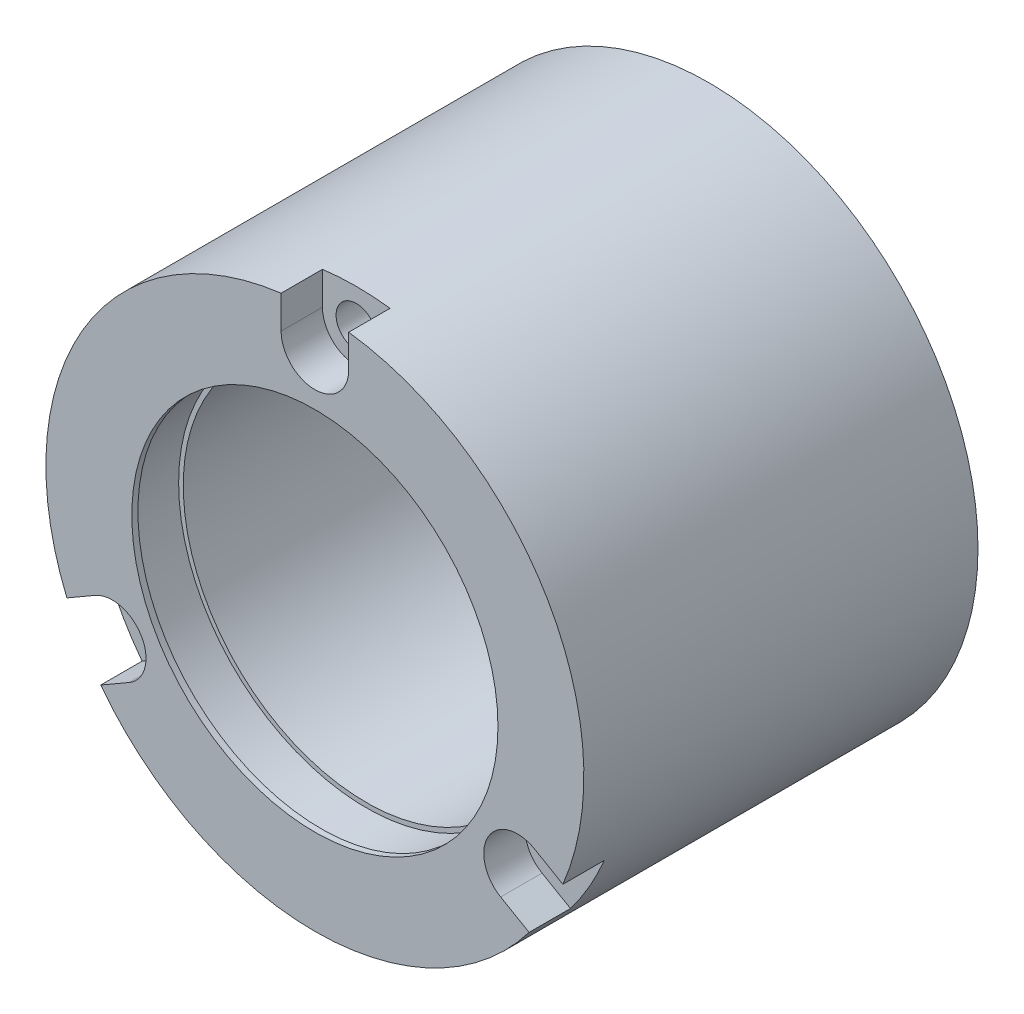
ISO-10303-21;
HEADER;
FILE_DESCRIPTION(('STEP AP214'),'2;1');
FILE_NAME('part.step','',(''),(''),'','','');
FILE_SCHEMA(('AUTOMOTIVE_DESIGN { 1 0 10303 214 1 1 1 1 }'));
ENDSEC;
DATA;
#1=APPLICATION_CONTEXT('core data for automotive mechanical design processes');
#2=APPLICATION_PROTOCOL_DEFINITION('international standard','automotive_design',2000,#1);
#3=PRODUCT_CONTEXT('',#1,'mechanical');
#4=PRODUCT('Part','Part','',(#3));
#5=PRODUCT_RELATED_PRODUCT_CATEGORY('part','',(#4));
#6=PRODUCT_DEFINITION_FORMATION('','',#4);
#7=PRODUCT_DEFINITION_CONTEXT('part definition',#1,'design');
#8=PRODUCT_DEFINITION('design','',#6,#7);
#9=PRODUCT_DEFINITION_SHAPE('','',#8);
#10=(LENGTH_UNIT() NAMED_UNIT(*) SI_UNIT(.MILLI.,.METRE.));
#11=(NAMED_UNIT(*) PLANE_ANGLE_UNIT() SI_UNIT($,.RADIAN.));
#12=(NAMED_UNIT(*) SI_UNIT($,.STERADIAN.) SOLID_ANGLE_UNIT());
#13=UNCERTAINTY_MEASURE_WITH_UNIT(LENGTH_MEASURE(1.E-05),#10,'distance_accuracy_value','');
#14=(GEOMETRIC_REPRESENTATION_CONTEXT(3) GLOBAL_UNCERTAINTY_ASSIGNED_CONTEXT((#13)) GLOBAL_UNIT_ASSIGNED_CONTEXT((#10,
#11,#12)) REPRESENTATION_CONTEXT('',''));
#15=CARTESIAN_POINT('',(0.,0.,0.));
#16=DIRECTION('',(0.,0.,1.));
#17=DIRECTION('',(1.,0.,0.));
#18=AXIS2_PLACEMENT_3D('',#15,#16,#17);
#19=CARTESIAN_POINT('',(0.,0.,0.));
#20=DIRECTION('',(0.,0.,1.));
#21=DIRECTION('',(1.,0.,0.));
#22=AXIS2_PLACEMENT_3D('',#19,#20,#21);
#23=PLANE('',#22);
#24=CARTESIAN_POINT('',(0.,0.,0.));
#25=DIRECTION('',(0.,0.,1.));
#26=DIRECTION('',(1.,0.,0.));
#27=AXIS2_PLACEMENT_3D('',#24,#25,#26);
#28=CIRCLE('',#27,23.5966);
#29=CARTESIAN_POINT('',(23.5966,0.,0.));
#30=VERTEX_POINT('',#29);
#31=EDGE_CURVE('E700',#30,#30,#28,.T.);
#32=ORIENTED_EDGE('',*,*,#31,.T.);
#33=EDGE_LOOP('',(#32));
#34=FACE_BOUND('',#33,.T.);
#35=CARTESIAN_POINT('',(0.,0.,0.));
#36=DIRECTION('',(0.,0.,-1.));
#37=DIRECTION('',(-1.,0.,0.));
#38=AXIS2_PLACEMENT_3D('',#35,#36,#37);
#39=CIRCLE('',#38,25.2603);
#40=CARTESIAN_POINT('',(-25.2603,0.,0.));
#41=VERTEX_POINT('',#40);
#42=EDGE_CURVE('E730',#41,#41,#39,.T.);
#43=ORIENTED_EDGE('',*,*,#42,.T.);
#44=EDGE_LOOP('',(#43));
#45=FACE_BOUND('',#44,.T.);
#46=ADVANCED_FACE('F17',(#34,#45),#23,.F.);
#47=CARTESIAN_POINT('',(0.,0.,50.8));
#48=DIRECTION('',(0.,0.,-1.));
#49=DIRECTION('',(-1.,0.,0.));
#50=AXIS2_PLACEMENT_3D('',#47,#48,#49);
#51=CYLINDRICAL_SURFACE('',#50,34.671);
#52=CARTESIAN_POINT('',(0.,0.,0.));
#53=DIRECTION('',(0.,0.,1.));
#54=DIRECTION('',(1.,0.,0.));
#55=AXIS2_PLACEMENT_3D('',#52,#53,#54);
#56=CIRCLE('',#55,34.671);
#57=CARTESIAN_POINT('',(34.671,0.,0.));
#58=VERTEX_POINT('',#57);
#59=EDGE_CURVE('E21',#58,#58,#56,.T.);
#60=ORIENTED_EDGE('',*,*,#59,.T.);
#61=EDGE_LOOP('',(#60));
#62=FACE_BOUND('',#61,.T.);
#63=DIRECTION('',(0.,0.,-1.));
#64=VECTOR('',#63,1.);
#65=CARTESIAN_POINT('',(27.6099840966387,-20.9706227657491,50.8));
#66=LINE('',#65,#64);
#67=CARTESIAN_POINT('',(27.6099840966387,-20.9706227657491,50.8));
#68=VERTEX_POINT('',#67);
#69=CARTESIAN_POINT('',(27.6099840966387,-20.9706227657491,45.466));
#70=VERTEX_POINT('',#69);
#71=EDGE_CURVE('E152',#68,#70,#66,.T.);
#72=ORIENTED_EDGE('',*,*,#71,.F.);
#73=CARTESIAN_POINT('',(0.,0.,50.8));
#74=DIRECTION('',(0.,0.,1.));
#75=DIRECTION('',(1.,0.,0.));
#76=AXIS2_PLACEMENT_3D('',#73,#74,#75);
#77=CIRCLE('',#76,34.671);
#78=CARTESIAN_POINT('',(-27.6099840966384,-20.9706227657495,50.8));
#79=VERTEX_POINT('',#78);
#80=EDGE_CURVE('E27',#79,#68,#77,.T.);
#81=ORIENTED_EDGE('',*,*,#80,.F.);
#82=DIRECTION('',(0.,0.,-1.));
#83=VECTOR('',#82,1.);
#84=CARTESIAN_POINT('',(-27.6099840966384,-20.9706227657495,50.8));
#85=LINE('',#84,#83);
#86=CARTESIAN_POINT('',(-27.6099840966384,-20.9706227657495,45.466));
#87=VERTEX_POINT('',#86);
#88=EDGE_CURVE('E779',#79,#87,#85,.T.);
#89=ORIENTED_EDGE('',*,*,#88,.T.);
#90=CARTESIAN_POINT('',(0.,0.,45.466));
#91=DIRECTION('',(0.,0.,1.));
#92=DIRECTION('',(-0.500000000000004,0.866025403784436,0.));
#93=AXIS2_PLACEMENT_3D('',#90,#91,#92);
#94=CIRCLE('',#93,34.671);
#95=CARTESIAN_POINT('',(-31.9660840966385,-13.4256362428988,45.466));
#96=VERTEX_POINT('',#95);
#97=EDGE_CURVE('E772',#96,#87,#94,.T.);
#98=ORIENTED_EDGE('',*,*,#97,.F.);
#99=DIRECTION('',(0.,0.,-1.));
#100=VECTOR('',#99,1.);
#101=CARTESIAN_POINT('',(-31.9660840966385,-13.4256362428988,50.8));
#102=LINE('',#101,#100);
#103=CARTESIAN_POINT('',(-31.9660840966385,-13.4256362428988,50.8));
#104=VERTEX_POINT('',#103);
#105=EDGE_CURVE('E178',#104,#96,#102,.T.);
#106=ORIENTED_EDGE('',*,*,#105,.F.);
#107=CARTESIAN_POINT('',(-4.35609999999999,34.396259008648,50.8));
#108=VERTEX_POINT('',#107);
#109=EDGE_CURVE('E11',#108,#104,#77,.T.);
#110=ORIENTED_EDGE('',*,*,#109,.F.);
#111=DIRECTION('',(0.,0.,-1.));
#112=VECTOR('',#111,1.);
#113=CARTESIAN_POINT('',(-4.35609999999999,34.396259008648,50.8));
#114=LINE('',#113,#112);
#115=CARTESIAN_POINT('',(-4.35609999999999,34.396259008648,45.466));
#116=VERTEX_POINT('',#115);
#117=EDGE_CURVE('E209',#108,#116,#114,.T.);
#118=ORIENTED_EDGE('',*,*,#117,.T.);
#119=CARTESIAN_POINT('',(0.,0.,45.466));
#120=DIRECTION('',(0.,0.,1.));
#121=DIRECTION('',(1.,0.,0.));
#122=AXIS2_PLACEMENT_3D('',#119,#120,#121);
#123=CIRCLE('',#122,34.671);
#124=CARTESIAN_POINT('',(4.35609999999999,34.396259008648,45.466));
#125=VERTEX_POINT('',#124);
#126=EDGE_CURVE('E201',#125,#116,#123,.T.);
#127=ORIENTED_EDGE('',*,*,#126,.F.);
#128=DIRECTION('',(0.,0.,-1.));
#129=VECTOR('',#128,1.);
#130=CARTESIAN_POINT('',(4.35609999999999,34.396259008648,50.8));
#131=LINE('',#130,#129);
#132=CARTESIAN_POINT('',(4.35609999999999,34.396259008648,50.8));
#133=VERTEX_POINT('',#132);
#134=EDGE_CURVE('E213',#133,#125,#131,.T.);
#135=ORIENTED_EDGE('',*,*,#134,.F.);
#136=CARTESIAN_POINT('',(31.9660840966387,-13.4256362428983,50.8));
#137=VERTEX_POINT('',#136);
#138=EDGE_CURVE('E28',#137,#133,#77,.T.);
#139=ORIENTED_EDGE('',*,*,#138,.F.);
#140=DIRECTION('',(0.,0.,-1.));
#141=VECTOR('',#140,1.);
#142=CARTESIAN_POINT('',(31.9660840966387,-13.4256362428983,50.8));
#143=LINE('',#142,#141);
#144=CARTESIAN_POINT('',(31.9660840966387,-13.4256362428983,45.466));
#145=VERTEX_POINT('',#144);
#146=EDGE_CURVE('E757',#137,#145,#143,.T.);
#147=ORIENTED_EDGE('',*,*,#146,.T.);
#148=CARTESIAN_POINT('',(0.,0.,45.466));
#149=DIRECTION('',(0.,0.,1.));
#150=DIRECTION('',(-0.499999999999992,-0.866025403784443,0.));
#151=AXIS2_PLACEMENT_3D('',#148,#149,#150);
#152=CIRCLE('',#151,34.671);
#153=EDGE_CURVE('E750',#70,#145,#152,.T.);
#154=ORIENTED_EDGE('',*,*,#153,.F.);
#155=EDGE_LOOP('',(#72,#81,#89,#98,#106,#110,#118,#127,#135,#139,#147,#154));
#156=FACE_BOUND('',#155,.T.);
#157=ADVANCED_FACE('F19',(#62,#156),#51,.T.);
#158=CARTESIAN_POINT('',(0.,0.,50.8));
#159=DIRECTION('',(0.,0.,1.));
#160=DIRECTION('',(1.,0.,0.));
#161=AXIS2_PLACEMENT_3D('',#158,#159,#160);
#162=PLANE('',#161);
#163=CARTESIAN_POINT('',(0.,0.,50.8));
#164=DIRECTION('',(0.,0.,1.));
#165=DIRECTION('',(1.,0.,0.));
#166=AXIS2_PLACEMENT_3D('',#163,#164,#165);
#167=CIRCLE('',#166,23.5966);
#168=CARTESIAN_POINT('',(23.5966,0.,50.8));
#169=VERTEX_POINT('',#168);
#170=EDGE_CURVE('E699',#169,#169,#167,.T.);
#171=ORIENTED_EDGE('',*,*,#170,.F.);
#172=EDGE_LOOP('',(#171));
#173=FACE_BOUND('',#172,.T.);
#174=ORIENTED_EDGE('',*,*,#80,.T.);
#175=DIRECTION('',(0.866025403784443,-0.499999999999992,0.));
#176=VECTOR('',#175,1.);
#177=CARTESIAN_POINT('',(27.6099840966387,-20.9706227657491,50.8));
#178=LINE('',#177,#176);
#179=CARTESIAN_POINT('',(23.9434412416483,-18.8537432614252,50.8));
#180=VERTEX_POINT('',#179);
#181=EDGE_CURVE('E143',#180,#68,#178,.T.);
#182=ORIENTED_EDGE('',*,*,#181,.F.);
#183=CARTESIAN_POINT('',(26.1214912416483,-15.0812499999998,50.8));
#184=DIRECTION('',(0.,0.,1.));
#185=DIRECTION('',(1.,0.,0.));
#186=AXIS2_PLACEMENT_3D('',#183,#184,#185);
#187=CIRCLE('',#186,4.35609999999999);
#188=CARTESIAN_POINT('',(28.2995412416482,-11.3087567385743,50.8));
#189=VERTEX_POINT('',#188);
#190=EDGE_CURVE('E159',#189,#180,#187,.T.);
#191=ORIENTED_EDGE('',*,*,#190,.F.);
#192=DIRECTION('',(-0.866025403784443,0.499999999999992,0.));
#193=VECTOR('',#192,1.);
#194=CARTESIAN_POINT('',(31.9660840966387,-13.4256362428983,50.8));
#195=LINE('',#194,#193);
#196=EDGE_CURVE('E163',#137,#189,#195,.T.);
#197=ORIENTED_EDGE('',*,*,#196,.F.);
#198=ORIENTED_EDGE('',*,*,#138,.T.);
#199=DIRECTION('',(0.,1.,0.));
#200=VECTOR('',#199,1.);
#201=CARTESIAN_POINT('',(4.35609999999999,34.396259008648,50.8));
#202=LINE('',#201,#200);
#203=CARTESIAN_POINT('',(4.3561,30.1625,50.8));
#204=VERTEX_POINT('',#203);
#205=EDGE_CURVE('E190',#204,#133,#202,.T.);
#206=ORIENTED_EDGE('',*,*,#205,.F.);
#207=CARTESIAN_POINT('',(0.,30.1625,50.8));
#208=DIRECTION('',(0.,0.,1.));
#209=DIRECTION('',(1.,0.,0.));
#210=AXIS2_PLACEMENT_3D('',#207,#208,#209);
#211=CIRCLE('',#210,4.35609999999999);
#212=CARTESIAN_POINT('',(-4.35609999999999,30.1625,50.8));
#213=VERTEX_POINT('',#212);
#214=EDGE_CURVE('E221',#213,#204,#211,.T.);
#215=ORIENTED_EDGE('',*,*,#214,.F.);
#216=DIRECTION('',(0.,-1.,0.));
#217=VECTOR('',#216,1.);
#218=CARTESIAN_POINT('',(-4.35609999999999,34.396259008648,50.8));
#219=LINE('',#218,#217);
#220=EDGE_CURVE('E194',#108,#213,#219,.T.);
#221=ORIENTED_EDGE('',*,*,#220,.F.);
#222=ORIENTED_EDGE('',*,*,#109,.T.);
#223=DIRECTION('',(-0.866025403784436,-0.500000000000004,0.));
#224=VECTOR('',#223,1.);
#225=CARTESIAN_POINT('',(-31.9660840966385,-13.4256362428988,50.8));
#226=LINE('',#225,#224);
#227=CARTESIAN_POINT('',(-28.2995412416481,-11.3087567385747,50.8));
#228=VERTEX_POINT('',#227);
#229=EDGE_CURVE('E763',#228,#104,#226,.T.);
#230=ORIENTED_EDGE('',*,*,#229,.F.);
#231=CARTESIAN_POINT('',(-26.1214912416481,-15.0812500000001,50.8));
#232=DIRECTION('',(0.,0.,1.));
#233=DIRECTION('',(1.,0.,0.));
#234=AXIS2_PLACEMENT_3D('',#231,#232,#233);
#235=CIRCLE('',#234,4.35609999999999);
#236=CARTESIAN_POINT('',(-23.943441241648,-18.8537432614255,50.8));
#237=VERTEX_POINT('',#236);
#238=EDGE_CURVE('E175',#237,#228,#235,.T.);
#239=ORIENTED_EDGE('',*,*,#238,.F.);
#240=DIRECTION('',(0.866025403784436,0.500000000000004,0.));
#241=VECTOR('',#240,1.);
#242=CARTESIAN_POINT('',(-27.6099840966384,-20.9706227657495,50.8));
#243=LINE('',#242,#241);
#244=EDGE_CURVE('E766',#79,#237,#243,.T.);
#245=ORIENTED_EDGE('',*,*,#244,.F.);
#246=EDGE_LOOP('',(#174,#182,#191,#197,#198,#206,#215,#221,#222,#230,#239,#245));
#247=FACE_BOUND('',#246,.T.);
#248=ADVANCED_FACE('F157',(#173,#247),#162,.T.);
#249=CARTESIAN_POINT('',(0.,30.1625,0.));
#250=DIRECTION('',(0.,0.,1.));
#251=DIRECTION('',(1.,0.,0.));
#252=AXIS2_PLACEMENT_3D('',#249,#250,#251);
#253=CIRCLE('',#252,2.60349999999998);
#254=CARTESIAN_POINT('',(2.60349999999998,30.1625,0.));
#255=VERTEX_POINT('',#254);
#256=EDGE_CURVE('E713',#255,#255,#253,.T.);
#257=ORIENTED_EDGE('',*,*,#256,.T.);
#258=EDGE_LOOP('',(#257));
#259=FACE_BOUND('',#258,.T.);
#260=CARTESIAN_POINT('',(-26.1214912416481,-15.0812500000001,0.));
#261=DIRECTION('',(0.,0.,1.));
#262=DIRECTION('',(1.,0.,0.));
#263=AXIS2_PLACEMENT_3D('',#260,#261,#262);
#264=CIRCLE('',#263,2.60349999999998);
#265=CARTESIAN_POINT('',(-23.5179912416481,-15.0812500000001,0.));
#266=VERTEX_POINT('',#265);
#267=EDGE_CURVE('E849',#266,#266,#264,.T.);
#268=ORIENTED_EDGE('',*,*,#267,.T.);
#269=EDGE_LOOP('',(#268));
#270=FACE_BOUND('',#269,.T.);
#271=CARTESIAN_POINT('',(26.1214912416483,-15.0812499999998,0.));
#272=DIRECTION('',(0.,0.,1.));
#273=DIRECTION('',(1.,0.,0.));
#274=AXIS2_PLACEMENT_3D('',#271,#272,#273);
#275=CIRCLE('',#274,2.60349999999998);
#276=CARTESIAN_POINT('',(28.7249912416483,-15.0812499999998,0.));
#277=VERTEX_POINT('',#276);
#278=EDGE_CURVE('E859',#277,#277,#275,.T.);
#279=ORIENTED_EDGE('',*,*,#278,.T.);
#280=EDGE_LOOP('',(#279));
#281=FACE_BOUND('',#280,.T.);
#282=CARTESIAN_POINT('',(0.,0.,0.));
#283=DIRECTION('',(0.,0.,-1.));
#284=DIRECTION('',(-1.,0.,0.));
#285=AXIS2_PLACEMENT_3D('',#282,#283,#284);
#286=CIRCLE('',#285,27.0383);
#287=CARTESIAN_POINT('',(-27.0383,0.,0.));
#288=VERTEX_POINT('',#287);
#289=EDGE_CURVE('E735',#288,#288,#286,.T.);
#290=ORIENTED_EDGE('',*,*,#289,.F.);
#291=EDGE_LOOP('',(#290));
#292=FACE_BOUND('',#291,.T.);
#293=ORIENTED_EDGE('',*,*,#59,.F.);
#294=EDGE_LOOP('',(#293));
#295=FACE_BOUND('',#294,.T.);
#296=ADVANCED_FACE('F364',(#259,#270,#281,#292,#295),#23,.F.);
#297=CARTESIAN_POINT('',(2.6035,30.1625,45.466));
#298=DIRECTION('',(0.,0.,-1.));
#299=DIRECTION('',(-1.,0.,0.));
#300=AXIS2_PLACEMENT_3D('',#297,#298,#299);
#301=PLANE('',#300);
#302=CARTESIAN_POINT('',(0.,30.1625,45.466));
#303=DIRECTION('',(0.,0.,1.));
#304=DIRECTION('',(1.,0.,0.));
#305=AXIS2_PLACEMENT_3D('',#302,#303,#304);
#306=CIRCLE('',#305,2.6035);
#307=CARTESIAN_POINT('',(2.6035,30.1625,45.466));
#308=VERTEX_POINT('',#307);
#309=EDGE_CURVE('E709',#308,#308,#306,.T.);
#310=ORIENTED_EDGE('',*,*,#309,.F.);
#311=EDGE_LOOP('',(#310));
#312=FACE_BOUND('',#311,.T.);
#313=CARTESIAN_POINT('',(0.,30.1625,45.466));
#314=DIRECTION('',(0.,0.,1.));
#315=DIRECTION('',(1.,0.,0.));
#316=AXIS2_PLACEMENT_3D('',#313,#314,#315);
#317=CIRCLE('',#316,4.3561);
#318=CARTESIAN_POINT('',(-4.3561,30.1625,45.466));
#319=VERTEX_POINT('',#318);
#320=CARTESIAN_POINT('',(4.3561,30.1625,45.466));
#321=VERTEX_POINT('',#320);
#322=EDGE_CURVE('E225',#319,#321,#317,.T.);
#323=ORIENTED_EDGE('',*,*,#322,.T.);
#324=DIRECTION('',(0.,1.,0.));
#325=VECTOR('',#324,1.);
#326=CARTESIAN_POINT('',(4.35609999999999,34.396259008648,45.466));
#327=LINE('',#326,#325);
#328=EDGE_CURVE('E189',#321,#125,#327,.T.);
#329=ORIENTED_EDGE('',*,*,#328,.T.);
#330=ORIENTED_EDGE('',*,*,#126,.T.);
#331=DIRECTION('',(0.,-1.,0.));
#332=VECTOR('',#331,1.);
#333=CARTESIAN_POINT('',(-4.35609999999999,34.396259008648,45.466));
#334=LINE('',#333,#332);
#335=EDGE_CURVE('E195',#116,#319,#334,.T.);
#336=ORIENTED_EDGE('',*,*,#335,.T.);
#337=EDGE_LOOP('',(#323,#329,#330,#336));
#338=FACE_BOUND('',#337,.T.);
#339=ADVANCED_FACE('F356',(#312,#338),#301,.F.);
#340=CARTESIAN_POINT('',(0.,30.1625,50.8));
#341=DIRECTION('',(0.,0.,1.));
#342=DIRECTION('',(1.,0.,0.));
#343=AXIS2_PLACEMENT_3D('',#340,#341,#342);
#344=CYLINDRICAL_SURFACE('',#343,4.3561);
#345=ORIENTED_EDGE('',*,*,#214,.T.);
#346=DIRECTION('',(0.,0.,-1.));
#347=VECTOR('',#346,1.);
#348=CARTESIAN_POINT('',(4.3561,30.1625,50.8));
#349=LINE('',#348,#347);
#350=EDGE_CURVE('E217',#204,#321,#349,.T.);
#351=ORIENTED_EDGE('',*,*,#350,.T.);
#352=ORIENTED_EDGE('',*,*,#322,.F.);
#353=DIRECTION('',(0.,0.,-1.));
#354=VECTOR('',#353,1.);
#355=CARTESIAN_POINT('',(-4.35609999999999,30.1625,50.8));
#356=LINE('',#355,#354);
#357=EDGE_CURVE('E198',#213,#319,#356,.T.);
#358=ORIENTED_EDGE('',*,*,#357,.F.);
#359=EDGE_LOOP('',(#345,#351,#352,#358));
#360=FACE_BOUND('',#359,.T.);
#361=ADVANCED_FACE('F348',(#360),#344,.F.);
#362=CARTESIAN_POINT('',(4.35609999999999,34.396259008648,50.8));
#363=DIRECTION('',(-1.,0.,0.));
#364=DIRECTION('',(0.,-1.,0.));
#365=AXIS2_PLACEMENT_3D('',#362,#363,#364);
#366=PLANE('',#365);
#367=ORIENTED_EDGE('',*,*,#328,.F.);
#368=ORIENTED_EDGE('',*,*,#350,.F.);
#369=ORIENTED_EDGE('',*,*,#205,.T.);
#370=ORIENTED_EDGE('',*,*,#134,.T.);
#371=EDGE_LOOP('',(#367,#368,#369,#370));
#372=FACE_BOUND('',#371,.T.);
#373=ADVANCED_FACE('F340',(#372),#366,.T.);
#374=CARTESIAN_POINT('',(-4.35609999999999,34.396259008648,50.8));
#375=DIRECTION('',(1.,0.,0.));
#376=DIRECTION('',(0.,1.,0.));
#377=AXIS2_PLACEMENT_3D('',#374,#375,#376);
#378=PLANE('',#377);
#379=ORIENTED_EDGE('',*,*,#335,.F.);
#380=ORIENTED_EDGE('',*,*,#117,.F.);
#381=ORIENTED_EDGE('',*,*,#220,.T.);
#382=ORIENTED_EDGE('',*,*,#357,.T.);
#383=EDGE_LOOP('',(#379,#380,#381,#382));
#384=FACE_BOUND('',#383,.T.);
#385=ADVANCED_FACE('F332',(#384),#378,.T.);
#386=CARTESIAN_POINT('',(-23.5179912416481,-15.0812500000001,45.466));
#387=DIRECTION('',(0.,0.,-1.));
#388=DIRECTION('',(-1.,0.,0.));
#389=AXIS2_PLACEMENT_3D('',#386,#387,#388);
#390=PLANE('',#389);
#391=CARTESIAN_POINT('',(-26.1214912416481,-15.0812500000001,45.466));
#392=DIRECTION('',(0.,0.,1.));
#393=DIRECTION('',(1.,0.,0.));
#394=AXIS2_PLACEMENT_3D('',#391,#392,#393);
#395=CIRCLE('',#394,2.6035);
#396=CARTESIAN_POINT('',(-23.5179912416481,-15.0812500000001,45.466));
#397=VERTEX_POINT('',#396);
#398=EDGE_CURVE('E716',#397,#397,#395,.T.);
#399=ORIENTED_EDGE('',*,*,#398,.F.);
#400=EDGE_LOOP('',(#399));
#401=FACE_BOUND('',#400,.T.);
#402=CARTESIAN_POINT('',(-26.1214912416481,-15.0812500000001,45.466));
#403=DIRECTION('',(0.,0.,1.));
#404=DIRECTION('',(1.,0.,0.));
#405=AXIS2_PLACEMENT_3D('',#402,#403,#404);
#406=CIRCLE('',#405,4.3561);
#407=CARTESIAN_POINT('',(-23.943441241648,-18.8537432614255,45.466));
#408=VERTEX_POINT('',#407);
#409=CARTESIAN_POINT('',(-28.2995412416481,-11.3087567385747,45.466));
#410=VERTEX_POINT('',#409);
#411=EDGE_CURVE('E185',#408,#410,#406,.T.);
#412=ORIENTED_EDGE('',*,*,#411,.T.);
#413=DIRECTION('',(-0.866025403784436,-0.500000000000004,0.));
#414=VECTOR('',#413,1.);
#415=CARTESIAN_POINT('',(-31.9660840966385,-13.4256362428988,45.466));
#416=LINE('',#415,#414);
#417=EDGE_CURVE('E151',#410,#96,#416,.T.);
#418=ORIENTED_EDGE('',*,*,#417,.T.);
#419=ORIENTED_EDGE('',*,*,#97,.T.);
#420=DIRECTION('',(0.866025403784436,0.500000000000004,0.));
#421=VECTOR('',#420,1.);
#422=CARTESIAN_POINT('',(-27.6099840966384,-20.9706227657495,45.466));
#423=LINE('',#422,#421);
#424=EDGE_CURVE('E767',#87,#408,#423,.T.);
#425=ORIENTED_EDGE('',*,*,#424,.T.);
#426=EDGE_LOOP('',(#412,#418,#419,#425));
#427=FACE_BOUND('',#426,.T.);
#428=ADVANCED_FACE('F324',(#401,#427),#390,.F.);
#429=CARTESIAN_POINT('',(-26.1214912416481,-15.0812500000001,50.8));
#430=DIRECTION('',(0.,0.,1.));
#431=DIRECTION('',(1.,0.,0.));
#432=AXIS2_PLACEMENT_3D('',#429,#430,#431);
#433=CYLINDRICAL_SURFACE('',#432,4.3561);
#434=ORIENTED_EDGE('',*,*,#238,.T.);
#435=DIRECTION('',(0.,0.,-1.));
#436=VECTOR('',#435,1.);
#437=CARTESIAN_POINT('',(-28.2995412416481,-11.3087567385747,50.8));
#438=LINE('',#437,#436);
#439=EDGE_CURVE('E169',#228,#410,#438,.T.);
#440=ORIENTED_EDGE('',*,*,#439,.T.);
#441=ORIENTED_EDGE('',*,*,#411,.F.);
#442=DIRECTION('',(0.,0.,-1.));
#443=VECTOR('',#442,1.);
#444=CARTESIAN_POINT('',(-23.943441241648,-18.8537432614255,50.8));
#445=LINE('',#444,#443);
#446=EDGE_CURVE('E50',#237,#408,#445,.T.);
#447=ORIENTED_EDGE('',*,*,#446,.F.);
#448=EDGE_LOOP('',(#434,#440,#441,#447));
#449=FACE_BOUND('',#448,.T.);
#450=ADVANCED_FACE('F316',(#449),#433,.F.);
#451=CARTESIAN_POINT('',(28.7249912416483,-15.0812499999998,45.466));
#452=DIRECTION('',(0.,0.,-1.));
#453=DIRECTION('',(-1.,0.,0.));
#454=AXIS2_PLACEMENT_3D('',#451,#452,#453);
#455=PLANE('',#454);
#456=CARTESIAN_POINT('',(26.1214912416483,-15.0812499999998,45.466));
#457=DIRECTION('',(0.,0.,1.));
#458=DIRECTION('',(1.,0.,0.));
#459=AXIS2_PLACEMENT_3D('',#456,#457,#458);
#460=CIRCLE('',#459,2.6035);
#461=CARTESIAN_POINT('',(28.7249912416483,-15.0812499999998,45.466));
#462=VERTEX_POINT('',#461);
#463=EDGE_CURVE('E854',#462,#462,#460,.T.);
#464=ORIENTED_EDGE('',*,*,#463,.F.);
#465=EDGE_LOOP('',(#464));
#466=FACE_BOUND('',#465,.T.);
#467=CARTESIAN_POINT('',(26.1214912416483,-15.0812499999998,45.466));
#468=DIRECTION('',(0.,0.,1.));
#469=DIRECTION('',(1.,0.,0.));
#470=AXIS2_PLACEMENT_3D('',#467,#468,#469);
#471=CIRCLE('',#470,4.35609999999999);
#472=CARTESIAN_POINT('',(28.2995412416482,-11.3087567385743,45.466));
#473=VERTEX_POINT('',#472);
#474=CARTESIAN_POINT('',(23.9434412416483,-18.8537432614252,45.466));
#475=VERTEX_POINT('',#474);
#476=EDGE_CURVE('E168',#473,#475,#471,.T.);
#477=ORIENTED_EDGE('',*,*,#476,.T.);
#478=DIRECTION('',(0.866025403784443,-0.499999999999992,0.));
#479=VECTOR('',#478,1.);
#480=CARTESIAN_POINT('',(27.6099840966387,-20.9706227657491,45.466));
#481=LINE('',#480,#479);
#482=EDGE_CURVE('E145',#475,#70,#481,.T.);
#483=ORIENTED_EDGE('',*,*,#482,.T.);
#484=ORIENTED_EDGE('',*,*,#153,.T.);
#485=DIRECTION('',(-0.866025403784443,0.499999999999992,0.));
#486=VECTOR('',#485,1.);
#487=CARTESIAN_POINT('',(31.9660840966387,-13.4256362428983,45.466));
#488=LINE('',#487,#486);
#489=EDGE_CURVE('E164',#145,#473,#488,.T.);
#490=ORIENTED_EDGE('',*,*,#489,.T.);
#491=EDGE_LOOP('',(#477,#483,#484,#490));
#492=FACE_BOUND('',#491,.T.);
#493=ADVANCED_FACE('F309',(#466,#492),#455,.F.);
#494=CARTESIAN_POINT('',(26.1214912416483,-15.0812499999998,50.8));
#495=DIRECTION('',(0.,0.,1.));
#496=DIRECTION('',(1.,0.,0.));
#497=AXIS2_PLACEMENT_3D('',#494,#495,#496);
#498=CYLINDRICAL_SURFACE('',#497,4.35609999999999);
#499=ORIENTED_EDGE('',*,*,#190,.T.);
#500=DIRECTION('',(0.,0.,-1.));
#501=VECTOR('',#500,1.);
#502=CARTESIAN_POINT('',(23.9434412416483,-18.8537432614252,50.8));
#503=LINE('',#502,#501);
#504=EDGE_CURVE('E139',#180,#475,#503,.T.);
#505=ORIENTED_EDGE('',*,*,#504,.T.);
#506=ORIENTED_EDGE('',*,*,#476,.F.);
#507=DIRECTION('',(0.,0.,-1.));
#508=VECTOR('',#507,1.);
#509=CARTESIAN_POINT('',(28.2995412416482,-11.3087567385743,50.8));
#510=LINE('',#509,#508);
#511=EDGE_CURVE('E40',#189,#473,#510,.T.);
#512=ORIENTED_EDGE('',*,*,#511,.F.);
#513=EDGE_LOOP('',(#499,#505,#506,#512));
#514=FACE_BOUND('',#513,.T.);
#515=ADVANCED_FACE('F166',(#514),#498,.F.);
#516=CARTESIAN_POINT('',(-31.9660840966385,-13.4256362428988,50.8));
#517=DIRECTION('',(0.500000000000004,-0.866025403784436,0.));
#518=DIRECTION('',(0.866025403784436,0.500000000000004,0.));
#519=AXIS2_PLACEMENT_3D('',#516,#517,#518);
#520=PLANE('',#519);
#521=ORIENTED_EDGE('',*,*,#417,.F.);
#522=ORIENTED_EDGE('',*,*,#439,.F.);
#523=ORIENTED_EDGE('',*,*,#229,.T.);
#524=ORIENTED_EDGE('',*,*,#105,.T.);
#525=EDGE_LOOP('',(#521,#522,#523,#524));
#526=FACE_BOUND('',#525,.T.);
#527=ADVANCED_FACE('F295',(#526),#520,.T.);
#528=CARTESIAN_POINT('',(-27.6099840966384,-20.9706227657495,50.8));
#529=DIRECTION('',(-0.500000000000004,0.866025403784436,0.));
#530=DIRECTION('',(-0.866025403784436,-0.500000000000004,0.));
#531=AXIS2_PLACEMENT_3D('',#528,#529,#530);
#532=PLANE('',#531);
#533=ORIENTED_EDGE('',*,*,#424,.F.);
#534=ORIENTED_EDGE('',*,*,#88,.F.);
#535=ORIENTED_EDGE('',*,*,#244,.T.);
#536=ORIENTED_EDGE('',*,*,#446,.T.);
#537=EDGE_LOOP('',(#533,#534,#535,#536));
#538=FACE_BOUND('',#537,.T.);
#539=ADVANCED_FACE('F288',(#538),#532,.T.);
#540=CARTESIAN_POINT('',(27.6099840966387,-20.9706227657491,50.8));
#541=DIRECTION('',(0.499999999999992,0.866025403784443,0.));
#542=DIRECTION('',(-0.866025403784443,0.499999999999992,0.));
#543=AXIS2_PLACEMENT_3D('',#540,#541,#542);
#544=PLANE('',#543);
#545=ORIENTED_EDGE('',*,*,#482,.F.);
#546=ORIENTED_EDGE('',*,*,#504,.F.);
#547=ORIENTED_EDGE('',*,*,#181,.T.);
#548=ORIENTED_EDGE('',*,*,#71,.T.);
#549=EDGE_LOOP('',(#545,#546,#547,#548));
#550=FACE_BOUND('',#549,.T.);
#551=ADVANCED_FACE('F141',(#550),#544,.T.);
#552=CARTESIAN_POINT('',(31.9660840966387,-13.4256362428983,50.8));
#553=DIRECTION('',(-0.499999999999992,-0.866025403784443,0.));
#554=DIRECTION('',(0.866025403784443,-0.499999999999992,0.));
#555=AXIS2_PLACEMENT_3D('',#552,#553,#554);
#556=PLANE('',#555);
#557=ORIENTED_EDGE('',*,*,#489,.F.);
#558=ORIENTED_EDGE('',*,*,#146,.F.);
#559=ORIENTED_EDGE('',*,*,#196,.T.);
#560=ORIENTED_EDGE('',*,*,#511,.T.);
#561=EDGE_LOOP('',(#557,#558,#559,#560));
#562=FACE_BOUND('',#561,.T.);
#563=ADVANCED_FACE('F274',(#562),#556,.T.);
#564=CARTESIAN_POINT('',(0.,0.,1.651));
#565=DIRECTION('',(0.,0.,-1.));
#566=DIRECTION('',(-1.,0.,0.));
#567=AXIS2_PLACEMENT_3D('',#564,#565,#566);
#568=CYLINDRICAL_SURFACE('',#567,27.0383);
#569=CARTESIAN_POINT('',(0.,0.,1.651));
#570=DIRECTION('',(0.,0.,-1.));
#571=DIRECTION('',(-1.,0.,0.));
#572=AXIS2_PLACEMENT_3D('',#569,#570,#571);
#573=CIRCLE('',#572,27.0383);
#574=CARTESIAN_POINT('',(-27.0383,0.,1.651));
#575=VERTEX_POINT('',#574);
#576=EDGE_CURVE('E739',#575,#575,#573,.T.);
#577=CARTESIAN_POINT('',(-27.0383,0.,1.651));
#578=CARTESIAN_POINT('',(-27.0383,0.,1.63380208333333));
#579=CARTESIAN_POINT('',(-27.0383,0.,1.61660416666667));
#580=CARTESIAN_POINT('',(-27.0383,0.,1.58220833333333));
#581=CARTESIAN_POINT('',(-27.0383,0.,1.56501041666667));
#582=CARTESIAN_POINT('',(-27.0383,0.,1.53061458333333));
#583=CARTESIAN_POINT('',(-27.0383,0.,1.51341666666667));
#584=CARTESIAN_POINT('',(-27.0383,0.,1.47902083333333));
#585=CARTESIAN_POINT('',(-27.0383,0.,1.46182291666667));
#586=CARTESIAN_POINT('',(-27.0383,0.,1.42742708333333));
#587=CARTESIAN_POINT('',(-27.0383,0.,1.41022916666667));
#588=CARTESIAN_POINT('',(-27.0383,0.,1.37583333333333));
#589=CARTESIAN_POINT('',(-27.0383,0.,1.35863541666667));
#590=CARTESIAN_POINT('',(-27.0383,0.,1.32423958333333));
#591=CARTESIAN_POINT('',(-27.0383,0.,1.30704166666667));
#592=CARTESIAN_POINT('',(-27.0383,0.,1.27264583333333));
#593=CARTESIAN_POINT('',(-27.0383,0.,1.25544791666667));
#594=CARTESIAN_POINT('',(-27.0383,0.,1.22105208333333));
#595=CARTESIAN_POINT('',(-27.0383,0.,1.20385416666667));
#596=CARTESIAN_POINT('',(-27.0383,0.,1.16945833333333));
#597=CARTESIAN_POINT('',(-27.0383,0.,1.15226041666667));
#598=CARTESIAN_POINT('',(-27.0383,0.,1.11786458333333));
#599=CARTESIAN_POINT('',(-27.0383,0.,1.10066666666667));
#600=CARTESIAN_POINT('',(-27.0383,0.,1.06627083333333));
#601=CARTESIAN_POINT('',(-27.0383,0.,1.04907291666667));
#602=CARTESIAN_POINT('',(-27.0383,0.,1.01467708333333));
#603=CARTESIAN_POINT('',(-27.0383,0.,0.997479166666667));
#604=CARTESIAN_POINT('',(-27.0383,0.,0.963083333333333));
#605=CARTESIAN_POINT('',(-27.0383,0.,0.945885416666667));
#606=CARTESIAN_POINT('',(-27.0383,0.,0.911489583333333));
#607=CARTESIAN_POINT('',(-27.0383,0.,0.894291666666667));
#608=CARTESIAN_POINT('',(-27.0383,0.,0.859895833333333));
#609=CARTESIAN_POINT('',(-27.0383,0.,0.842697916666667));
#610=CARTESIAN_POINT('',(-27.0383,0.,0.808302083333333));
#611=CARTESIAN_POINT('',(-27.0383,0.,0.791104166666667));
#612=CARTESIAN_POINT('',(-27.0383,0.,0.756708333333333));
#613=CARTESIAN_POINT('',(-27.0383,0.,0.739510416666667));
#614=CARTESIAN_POINT('',(-27.0383,0.,0.705114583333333));
#615=CARTESIAN_POINT('',(-27.0383,0.,0.687916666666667));
#616=CARTESIAN_POINT('',(-27.0383,0.,0.653520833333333));
#617=CARTESIAN_POINT('',(-27.0383,0.,0.636322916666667));
#618=CARTESIAN_POINT('',(-27.0383,0.,0.601927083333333));
#619=CARTESIAN_POINT('',(-27.0383,0.,0.584729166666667));
#620=CARTESIAN_POINT('',(-27.0383,0.,0.550333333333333));
#621=CARTESIAN_POINT('',(-27.0383,0.,0.533135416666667));
#622=CARTESIAN_POINT('',(-27.0383,0.,0.498739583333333));
#623=CARTESIAN_POINT('',(-27.0383,0.,0.481541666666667));
#624=CARTESIAN_POINT('',(-27.0383,0.,0.447145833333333));
#625=CARTESIAN_POINT('',(-27.0383,0.,0.429947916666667));
#626=CARTESIAN_POINT('',(-27.0383,0.,0.395552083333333));
#627=CARTESIAN_POINT('',(-27.0383,0.,0.378354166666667));
#628=CARTESIAN_POINT('',(-27.0383,0.,0.343958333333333));
#629=CARTESIAN_POINT('',(-27.0383,0.,0.326760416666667));
#630=CARTESIAN_POINT('',(-27.0383,0.,0.292364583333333));
#631=CARTESIAN_POINT('',(-27.0383,0.,0.275166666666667));
#632=CARTESIAN_POINT('',(-27.0383,0.,0.240770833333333));
#633=CARTESIAN_POINT('',(-27.0383,0.,0.223572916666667));
#634=CARTESIAN_POINT('',(-27.0383,0.,0.189177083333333));
#635=CARTESIAN_POINT('',(-27.0383,0.,0.171979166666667));
#636=CARTESIAN_POINT('',(-27.0383,0.,0.137583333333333));
#637=CARTESIAN_POINT('',(-27.0383,0.,0.120385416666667));
#638=CARTESIAN_POINT('',(-27.0383,0.,0.0859895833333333));
#639=CARTESIAN_POINT('',(-27.0383,0.,0.0687916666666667));
#640=CARTESIAN_POINT('',(-27.0383,0.,0.0343958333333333));
#641=CARTESIAN_POINT('',(-27.0383,0.,0.0171979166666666));
#642=CARTESIAN_POINT('',(-27.0383,0.,0.));
#643=B_SPLINE_CURVE_WITH_KNOTS('',3,(#577,#578,#579,#580,#581,#582,#583,#584,#585,#586,#587,
#588,#589,#590,#591,#592,#593,#594,#595,#596,#597,#598,#599,#600,#601,#602,#603,#604,#605,#606,
#607,#608,#609,#610,#611,#612,#613,#614,#615,#616,#617,#618,#619,#620,#621,#622,#623,#624,#625,
#626,#627,#628,#629,#630,#631,#632,#633,#634,#635,#636,#637,#638,#639,#640,#641,#642),
.UNSPECIFIED.,.F.,.F.,(4,2,2,2,2,2,2,2,2,2,2,2,2,2,2,2,2,2,2,2,2,2,2,2,2,2,2,2,2,2,2,2,4),(0.,
0.05159375,0.1031875,0.15478125,0.206375,0.25796875,0.3095625,0.36115625,0.41275,0.46434375,
0.5159375,0.56753125,0.619125,0.67071875,0.7223125,0.77390625,0.8255,0.87709375,0.9286875,
0.98028125,1.031875,1.08346875,1.1350625,1.18665625,1.23825,1.28984375,1.3414375,1.39303125,
1.444625,1.49621875,1.5478125,1.59940625,1.651),.UNSPECIFIED.);
#644=EDGE_CURVE('BSEAM266',#575,#288,#643,.T.);
#645=ORIENTED_EDGE('',*,*,#576,.F.);
#646=ORIENTED_EDGE('',*,*,#289,.T.);
#647=ORIENTED_EDGE('',*,*,#644,.T.);
#648=ORIENTED_EDGE('',*,*,#644,.F.);
#649=EDGE_LOOP('',(#645,#647,#646,#648));
#650=FACE_BOUND('',#649,.T.);
#651=ADVANCED_FACE('F266',(#650),#568,.F.);
#652=CARTESIAN_POINT('',(0.,0.,1.651));
#653=DIRECTION('',(0.,0.,-1.));
#654=DIRECTION('',(-1.,0.,0.));
#655=AXIS2_PLACEMENT_3D('',#652,#653,#654);
#656=PLANE('',#655);
#657=CARTESIAN_POINT('',(0.,0.,1.651));
#658=DIRECTION('',(0.,0.,-1.));
#659=DIRECTION('',(-1.,0.,0.));
#660=AXIS2_PLACEMENT_3D('',#657,#658,#659);
#661=CIRCLE('',#660,25.2603);
#662=CARTESIAN_POINT('',(-25.2603,0.,1.651));
#663=VERTEX_POINT('',#662);
#664=EDGE_CURVE('E731',#663,#663,#661,.T.);
#665=ORIENTED_EDGE('',*,*,#664,.F.);
#666=EDGE_LOOP('',(#665));
#667=FACE_BOUND('',#666,.T.);
#668=ORIENTED_EDGE('',*,*,#576,.T.);
#669=EDGE_LOOP('',(#668));
#670=FACE_BOUND('',#669,.T.);
#671=ADVANCED_FACE('F256',(#667,#670),#656,.T.);
#672=CARTESIAN_POINT('',(0.,0.,1.651));
#673=DIRECTION('',(0.,0.,-1.));
#674=DIRECTION('',(-1.,0.,0.));
#675=AXIS2_PLACEMENT_3D('',#672,#673,#674);
#676=CYLINDRICAL_SURFACE('',#675,25.2603);
#677=CARTESIAN_POINT('',(-25.2603,0.,1.651));
#678=CARTESIAN_POINT('',(-25.2603,0.,1.63380208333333));
#679=CARTESIAN_POINT('',(-25.2603,0.,1.61660416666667));
#680=CARTESIAN_POINT('',(-25.2603,0.,1.58220833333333));
#681=CARTESIAN_POINT('',(-25.2603,0.,1.56501041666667));
#682=CARTESIAN_POINT('',(-25.2603,0.,1.53061458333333));
#683=CARTESIAN_POINT('',(-25.2603,0.,1.51341666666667));
#684=CARTESIAN_POINT('',(-25.2603,0.,1.47902083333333));
#685=CARTESIAN_POINT('',(-25.2603,0.,1.46182291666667));
#686=CARTESIAN_POINT('',(-25.2603,0.,1.42742708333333));
#687=CARTESIAN_POINT('',(-25.2603,0.,1.41022916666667));
#688=CARTESIAN_POINT('',(-25.2603,0.,1.37583333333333));
#689=CARTESIAN_POINT('',(-25.2603,0.,1.35863541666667));
#690=CARTESIAN_POINT('',(-25.2603,0.,1.32423958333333));
#691=CARTESIAN_POINT('',(-25.2603,0.,1.30704166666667));
#692=CARTESIAN_POINT('',(-25.2603,0.,1.27264583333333));
#693=CARTESIAN_POINT('',(-25.2603,0.,1.25544791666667));
#694=CARTESIAN_POINT('',(-25.2603,0.,1.22105208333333));
#695=CARTESIAN_POINT('',(-25.2603,0.,1.20385416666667));
#696=CARTESIAN_POINT('',(-25.2603,0.,1.16945833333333));
#697=CARTESIAN_POINT('',(-25.2603,0.,1.15226041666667));
#698=CARTESIAN_POINT('',(-25.2603,0.,1.11786458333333));
#699=CARTESIAN_POINT('',(-25.2603,0.,1.10066666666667));
#700=CARTESIAN_POINT('',(-25.2603,0.,1.06627083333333));
#701=CARTESIAN_POINT('',(-25.2603,0.,1.04907291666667));
#702=CARTESIAN_POINT('',(-25.2603,0.,1.01467708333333));
#703=CARTESIAN_POINT('',(-25.2603,0.,0.997479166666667));
#704=CARTESIAN_POINT('',(-25.2603,0.,0.963083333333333));
#705=CARTESIAN_POINT('',(-25.2603,0.,0.945885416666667));
#706=CARTESIAN_POINT('',(-25.2603,0.,0.911489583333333));
#707=CARTESIAN_POINT('',(-25.2603,0.,0.894291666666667));
#708=CARTESIAN_POINT('',(-25.2603,0.,0.859895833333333));
#709=CARTESIAN_POINT('',(-25.2603,0.,0.842697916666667));
#710=CARTESIAN_POINT('',(-25.2603,0.,0.808302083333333));
#711=CARTESIAN_POINT('',(-25.2603,0.,0.791104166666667));
#712=CARTESIAN_POINT('',(-25.2603,0.,0.756708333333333));
#713=CARTESIAN_POINT('',(-25.2603,0.,0.739510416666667));
#714=CARTESIAN_POINT('',(-25.2603,0.,0.705114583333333));
#715=CARTESIAN_POINT('',(-25.2603,0.,0.687916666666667));
#716=CARTESIAN_POINT('',(-25.2603,0.,0.653520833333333));
#717=CARTESIAN_POINT('',(-25.2603,0.,0.636322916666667));
#718=CARTESIAN_POINT('',(-25.2603,0.,0.601927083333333));
#719=CARTESIAN_POINT('',(-25.2603,0.,0.584729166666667));
#720=CARTESIAN_POINT('',(-25.2603,0.,0.550333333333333));
#721=CARTESIAN_POINT('',(-25.2603,0.,0.533135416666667));
#722=CARTESIAN_POINT('',(-25.2603,0.,0.498739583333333));
#723=CARTESIAN_POINT('',(-25.2603,0.,0.481541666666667));
#724=CARTESIAN_POINT('',(-25.2603,0.,0.447145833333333));
#725=CARTESIAN_POINT('',(-25.2603,0.,0.429947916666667));
#726=CARTESIAN_POINT('',(-25.2603,0.,0.395552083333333));
#727=CARTESIAN_POINT('',(-25.2603,0.,0.378354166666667));
#728=CARTESIAN_POINT('',(-25.2603,0.,0.343958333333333));
#729=CARTESIAN_POINT('',(-25.2603,0.,0.326760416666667));
#730=CARTESIAN_POINT('',(-25.2603,0.,0.292364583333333));
#731=CARTESIAN_POINT('',(-25.2603,0.,0.275166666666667));
#732=CARTESIAN_POINT('',(-25.2603,0.,0.240770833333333));
#733=CARTESIAN_POINT('',(-25.2603,0.,0.223572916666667));
#734=CARTESIAN_POINT('',(-25.2603,0.,0.189177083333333));
#735=CARTESIAN_POINT('',(-25.2603,0.,0.171979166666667));
#736=CARTESIAN_POINT('',(-25.2603,0.,0.137583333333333));
#737=CARTESIAN_POINT('',(-25.2603,0.,0.120385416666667));
#738=CARTESIAN_POINT('',(-25.2603,0.,0.0859895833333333));
#739=CARTESIAN_POINT('',(-25.2603,0.,0.0687916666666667));
#740=CARTESIAN_POINT('',(-25.2603,0.,0.0343958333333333));
#741=CARTESIAN_POINT('',(-25.2603,0.,0.0171979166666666));
#742=CARTESIAN_POINT('',(-25.2603,0.,0.));
#743=B_SPLINE_CURVE_WITH_KNOTS('',3,(#677,#678,#679,#680,#681,#682,#683,#684,#685,#686,#687,
#688,#689,#690,#691,#692,#693,#694,#695,#696,#697,#698,#699,#700,#701,#702,#703,#704,#705,#706,
#707,#708,#709,#710,#711,#712,#713,#714,#715,#716,#717,#718,#719,#720,#721,#722,#723,#724,#725,
#726,#727,#728,#729,#730,#731,#732,#733,#734,#735,#736,#737,#738,#739,#740,#741,#742),
.UNSPECIFIED.,.F.,.F.,(4,2,2,2,2,2,2,2,2,2,2,2,2,2,2,2,2,2,2,2,2,2,2,2,2,2,2,2,2,2,2,2,4),(0.,
0.05159375,0.1031875,0.15478125,0.206375,0.25796875,0.3095625,0.36115625,0.41275,0.46434375,
0.5159375,0.56753125,0.619125,0.67071875,0.7223125,0.77390625,0.8255,0.87709375,0.9286875,
0.98028125,1.031875,1.08346875,1.1350625,1.18665625,1.23825,1.28984375,1.3414375,1.39303125,
1.444625,1.49621875,1.5478125,1.59940625,1.651),.UNSPECIFIED.);
#744=EDGE_CURVE('BSEAM250',#663,#41,#743,.T.);
#745=ORIENTED_EDGE('',*,*,#664,.T.);
#746=ORIENTED_EDGE('',*,*,#42,.F.);
#747=ORIENTED_EDGE('',*,*,#744,.T.);
#748=ORIENTED_EDGE('',*,*,#744,.F.);
#749=EDGE_LOOP('',(#745,#747,#746,#748));
#750=FACE_BOUND('',#749,.T.);
#751=ADVANCED_FACE('F250',(#750),#676,.T.);
#752=CARTESIAN_POINT('',(26.1214912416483,-15.0812499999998,50.8));
#753=DIRECTION('',(0.,0.,1.));
#754=DIRECTION('',(1.,0.,0.));
#755=AXIS2_PLACEMENT_3D('',#752,#753,#754);
#756=CYLINDRICAL_SURFACE('',#755,2.60349999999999);
#757=ORIENTED_EDGE('',*,*,#278,.F.);
#758=EDGE_LOOP('',(#757));
#759=FACE_BOUND('',#758,.T.);
#760=ORIENTED_EDGE('',*,*,#463,.T.);
#761=EDGE_LOOP('',(#760));
#762=FACE_BOUND('',#761,.T.);
#763=ADVANCED_FACE('F255',(#759,#762),#756,.F.);
#764=CARTESIAN_POINT('',(-26.1214912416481,-15.0812500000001,50.8));
#765=DIRECTION('',(0.,0.,1.));
#766=DIRECTION('',(1.,0.,0.));
#767=AXIS2_PLACEMENT_3D('',#764,#765,#766);
#768=CYLINDRICAL_SURFACE('',#767,2.60349999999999);
#769=ORIENTED_EDGE('',*,*,#267,.F.);
#770=EDGE_LOOP('',(#769));
#771=FACE_BOUND('',#770,.T.);
#772=ORIENTED_EDGE('',*,*,#398,.T.);
#773=EDGE_LOOP('',(#772));
#774=FACE_BOUND('',#773,.T.);
#775=ADVANCED_FACE('F553',(#771,#774),#768,.F.);
#776=CARTESIAN_POINT('',(0.,30.1625,50.8));
#777=DIRECTION('',(0.,0.,1.));
#778=DIRECTION('',(1.,0.,0.));
#779=AXIS2_PLACEMENT_3D('',#776,#777,#778);
#780=CYLINDRICAL_SURFACE('',#779,2.60349999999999);
#781=ORIENTED_EDGE('',*,*,#256,.F.);
#782=EDGE_LOOP('',(#781));
#783=FACE_BOUND('',#782,.T.);
#784=ORIENTED_EDGE('',*,*,#309,.T.);
#785=EDGE_LOOP('',(#784));
#786=FACE_BOUND('',#785,.T.);
#787=ADVANCED_FACE('F567',(#783,#786),#780,.F.);
#788=CARTESIAN_POINT('',(0.,0.,50.0126));
#789=DIRECTION('',(0.,0.,1.));
#790=DIRECTION('',(1.,0.,0.));
#791=AXIS2_PLACEMENT_3D('',#788,#789,#790);
#792=PLANE('',#791);
#793=CARTESIAN_POINT('',(0.,0.,50.0126));
#794=DIRECTION('',(0.,0.,1.));
#795=DIRECTION('',(1.,0.,0.));
#796=AXIS2_PLACEMENT_3D('',#793,#794,#795);
#797=CIRCLE('',#796,23.5966);
#798=CARTESIAN_POINT('',(23.5966,0.,50.0126));
#799=VERTEX_POINT('',#798);
#800=EDGE_CURVE('E696',#799,#799,#797,.F.);
#801=ORIENTED_EDGE('',*,*,#800,.F.);
#802=EDGE_LOOP('',(#801));
#803=FACE_BOUND('',#802,.T.);
#804=CARTESIAN_POINT('',(0.,0.,50.0126));
#805=DIRECTION('',(0.,0.,1.));
#806=DIRECTION('',(1.,0.,0.));
#807=AXIS2_PLACEMENT_3D('',#804,#805,#806);
#808=CIRCLE('',#807,24.1935);
#809=CARTESIAN_POINT('',(24.1935,0.,50.0126));
#810=VERTEX_POINT('',#809);
#811=EDGE_CURVE('E707',#810,#810,#808,.T.);
#812=ORIENTED_EDGE('',*,*,#811,.F.);
#813=EDGE_LOOP('',(#812));
#814=FACE_BOUND('',#813,.T.);
#815=ADVANCED_FACE('F582',(#803,#814),#792,.F.);
#816=CARTESIAN_POINT('',(0.,0.,44.1706));
#817=DIRECTION('',(0.,0.,1.));
#818=DIRECTION('',(1.,0.,0.));
#819=AXIS2_PLACEMENT_3D('',#816,#817,#818);
#820=CYLINDRICAL_SURFACE('',#819,24.1935);
#821=CARTESIAN_POINT('',(0.,0.,44.1706));
#822=DIRECTION('',(0.,0.,1.));
#823=DIRECTION('',(1.,0.,0.));
#824=AXIS2_PLACEMENT_3D('',#821,#822,#823);
#825=CIRCLE('',#824,24.1935);
#826=CARTESIAN_POINT('',(24.1935,0.,44.1706));
#827=VERTEX_POINT('',#826);
#828=EDGE_CURVE('E726',#827,#827,#825,.T.);
#829=ORIENTED_EDGE('',*,*,#828,.F.);
#830=EDGE_LOOP('',(#829));
#831=FACE_BOUND('',#830,.T.);
#832=ORIENTED_EDGE('',*,*,#811,.T.);
#833=EDGE_LOOP('',(#832));
#834=FACE_BOUND('',#833,.T.);
#835=ADVANCED_FACE('F595',(#831,#834),#820,.F.);
#836=CARTESIAN_POINT('',(0.,0.,44.1706));
#837=DIRECTION('',(0.,0.,1.));
#838=DIRECTION('',(1.,0.,0.));
#839=AXIS2_PLACEMENT_3D('',#836,#837,#838);
#840=PLANE('',#839);
#841=ORIENTED_EDGE('',*,*,#828,.T.);
#842=EDGE_LOOP('',(#841));
#843=FACE_BOUND('',#842,.T.);
#844=CARTESIAN_POINT('',(0.,0.,44.1706));
#845=DIRECTION('',(0.,0.,1.));
#846=DIRECTION('',(1.,0.,0.));
#847=AXIS2_PLACEMENT_3D('',#844,#845,#846);
#848=CIRCLE('',#847,23.5966);
#849=CARTESIAN_POINT('',(23.5966,0.,44.1706));
#850=VERTEX_POINT('',#849);
#851=EDGE_CURVE('E723',#850,#850,#848,.F.);
#852=ORIENTED_EDGE('',*,*,#851,.T.);
#853=EDGE_LOOP('',(#852));
#854=FACE_BOUND('',#853,.T.);
#855=ADVANCED_FACE('F605',(#843,#854),#840,.T.);
#856=CARTESIAN_POINT('',(0.,0.,0.));
#857=DIRECTION('',(0.,0.,1.));
#858=DIRECTION('',(1.,0.,0.));
#859=AXIS2_PLACEMENT_3D('',#856,#857,#858);
#860=CYLINDRICAL_SURFACE('',#859,23.5966);
#861=ORIENTED_EDGE('',*,*,#31,.F.);
#862=EDGE_LOOP('',(#861));
#863=FACE_BOUND('',#862,.T.);
#864=ORIENTED_EDGE('',*,*,#851,.F.);
#865=EDGE_LOOP('',(#864));
#866=FACE_BOUND('',#865,.T.);
#867=ADVANCED_FACE('F618',(#863,#866),#860,.F.);
#868=CARTESIAN_POINT('',(0.,0.,0.));
#869=DIRECTION('',(0.,0.,1.));
#870=DIRECTION('',(1.,0.,0.));
#871=AXIS2_PLACEMENT_3D('',#868,#869,#870);
#872=CYLINDRICAL_SURFACE('',#871,23.5966);
#873=ORIENTED_EDGE('',*,*,#800,.T.);
#874=EDGE_LOOP('',(#873));
#875=FACE_BOUND('',#874,.T.);
#876=ORIENTED_EDGE('',*,*,#170,.T.);
#877=EDGE_LOOP('',(#876));
#878=FACE_BOUND('',#877,.T.);
#879=ADVANCED_FACE('F630',(#875,#878),#872,.F.);
#880=CLOSED_SHELL('',(#46,#157,#248,#296,#339,#361,#373,#385,#428,#450,#493,#515,#527,#539,#551,
#563,#651,#671,#751,#763,#775,#787,#815,#835,#855,#867,#879));
#881=MANIFOLD_SOLID_BREP('B1',#880);
#882=ADVANCED_BREP_SHAPE_REPRESENTATION('',(#18,#881),#14);
#883=SHAPE_DEFINITION_REPRESENTATION(#9,#882);
ENDSEC;
END-ISO-10303-21;
